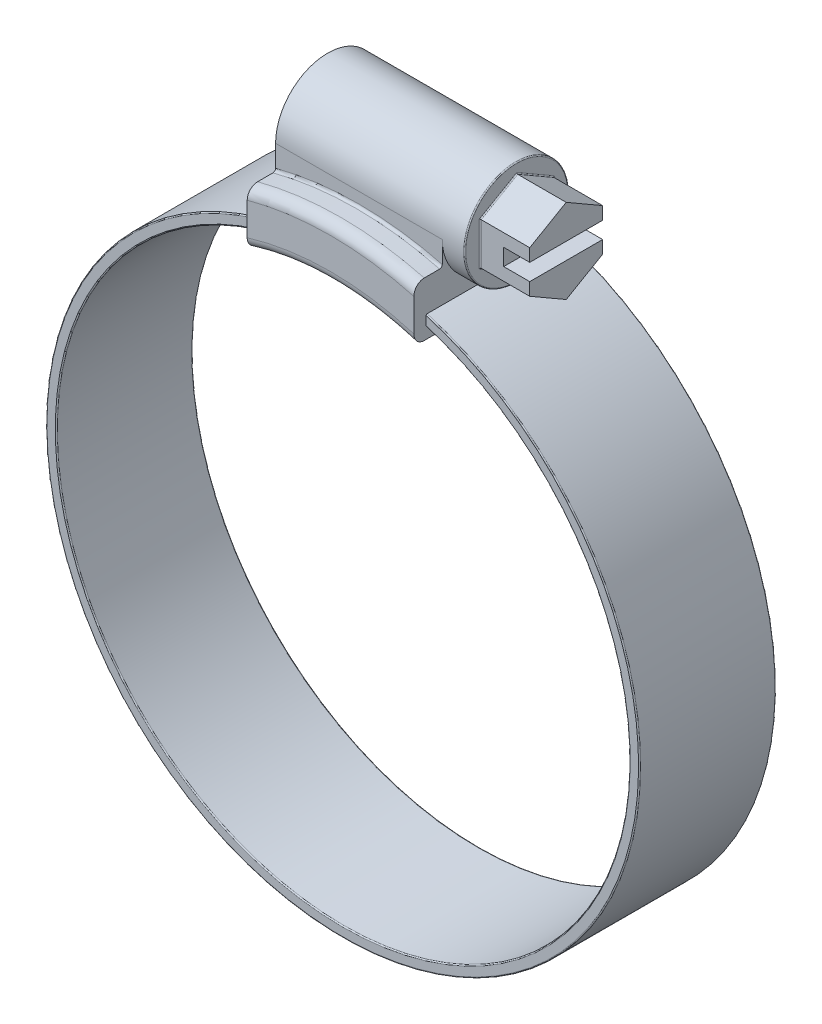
from build123d import *

# Parameters (mm, degrees)
SKETCH1_R                       = 28.5
SKETCH1_R_2                     = 27.5
EXTRUDE_THIN1_DEPTH             = 6.55
BOSS_EXTRUDE1_DEPTH             = 7.725
BOSS_EXTRUDE2_REACH             = 45.176
BOSS_EXTRUDE2_DIRECTION_2_REACH = 45.176
SKETCH7_R                       = 5
BOSS_EXTRUDE4_DEPTH             = 2.15
BOSS_EXTRUDE5_DEPTH             = 4.75
CUT_EXTRUDE1_DEPTH              = 2.5
FILLET1_R                       = 0.1
FILLET2_R                       = 1
FILLET3_R                       = 0.25


with BuildPart() as part:
    # Sketch1 → Extrude-Thin1 (new, symmetric)
    with BuildSketch(Plane.XY):
        Circle(SKETCH1_R)
        Circle(SKETCH1_R_2, mode=Mode.SUBTRACT)
    extrude(amount=EXTRUDE_THIN1_DEPTH, both=True)

    # Sketch2 → Boss-Extrude1 (add, symmetric)
    with BuildSketch(Plane.XY):
        with BuildLine():
            Line((-8, 30.467195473), (-8, 25.263610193))
            ThreePointArc((-8, 25.263610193), (0, 26.5), (8, 25.263610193))
            Line((8, 25.263610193), (8, 30.467195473))
            ThreePointArc((8, 30.467195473), (0, 31.5), (-8, 30.467195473))
        make_face()
    extrude(amount=BOSS_EXTRUDE1_DEPTH, both=True)

    # Boss-Extrude2: up to this face of the body (flat: up to its plane)
    boss_extrude2_end = Plane(part.part.faces().sort_by_distance((8, 28.077034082, 0))[0])
    # Sketch4 → Boss-Extrude2 (add, up to the picked face)
    with BuildSketch(Plane(origin=(0, 0, 0), x_dir=(0, 0, -1), z_dir=(1, 0, 0)), mode=Mode.PRIVATE) as boss_extrude2_sk1:
        with BuildLine():
            Line((-5, 32.8), (-5, 30.467195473))
            Line((-5, 30.467195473), (5, 30.467195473))
            Line((5, 30.467195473), (5, 32.8))
            ThreePointArc((5, 32.8), (0, 37.8), (-5, 32.8))
        make_face()
    boss_extrude2_tool1 = split(extrude(boss_extrude2_sk1.sketch, amount=BOSS_EXTRUDE2_REACH, mode=Mode.PRIVATE), bisect_by=boss_extrude2_end, keep=Keep.BOTH, mode=Mode.PRIVATE)
    add(boss_extrude2_tool1.solids().sort_by(Axis((0, 33.69657, 0), (1, 0, 0)))[0])

    # Boss-Extrude2 direction 2: up to this face of the body (flat: up to its plane)
    boss_extrude2_direction_2_end = Plane(part.part.faces().sort_by_distance((-8, 28.077034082, 0))[0])
    # Sketch4 → Boss-Extrude2 direction 2 (add, up to the picked face)
    with BuildSketch(Plane(origin=(0, 0, 0), x_dir=(0, 0, -1), z_dir=(1, 0, 0)), mode=Mode.PRIVATE) as boss_extrude2_direction_2_sk1:
        with BuildLine():
            Line((-5, 32.8), (-5, 30.467195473))
            Line((-5, 30.467195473), (5, 30.467195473))
            Line((5, 30.467195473), (5, 32.8))
            ThreePointArc((5, 32.8), (0, 37.8), (-5, 32.8))
        make_face()
    boss_extrude2_direction_2_tool1 = split(extrude(boss_extrude2_direction_2_sk1.sketch, amount=-BOSS_EXTRUDE2_DIRECTION_2_REACH, mode=Mode.PRIVATE), bisect_by=boss_extrude2_direction_2_end, keep=Keep.BOTH, mode=Mode.PRIVATE)
    add(boss_extrude2_direction_2_tool1.solids().sort_by(Axis((0, 33.69657, 0), (-1, 0, 0)))[0])

    # Sketch7 → Boss-Extrude4 (add)
    with BuildSketch(Plane(origin=(8, 0, 0), x_dir=(0, 0, -1), z_dir=(1, 0, 0))):
        with Locations((0, 32.8)):
            Circle(SKETCH7_R)
    extrude(amount=BOSS_EXTRUDE4_DEPTH)

    # Sketch8 → Boss-Extrude5 (add)
    with BuildSketch(Plane(origin=(10.15, 0, 0), x_dir=(0, 0, -1), z_dir=(1, 0, 0))):
        Polygon((0.000452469, 28.758548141), (3.500226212, 30.77966592), (3.499773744, 34.821117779), (-0.000452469, 36.841451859), (-3.500226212, 34.82033408), (-3.499773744, 30.778882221), align=None)
    extrude(amount=BOSS_EXTRUDE5_DEPTH)

    # Sketch9 → Cut-Extrude1 (cut)
    with BuildSketch(Plane(origin=(14.9, 0, 0), x_dir=(0, 0, -1), z_dir=(1, 0, 0))):
        Polygon((-3.95886158, 31.999556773), (3.959040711, 32.000443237), (3.95886158, 33.600443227), (-3.959040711, 33.599556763), align=None)
    extrude(amount=-CUT_EXTRUDE1_DEPTH, mode=Mode.SUBTRACT)

    # Fillet1
    fillet1_edges = [part.edges().sort_by_distance(p)[0] for p in [
        (0, -28.5, 6.55),
        (0, -28.5, -6.55),
        (10.15, 32.8, 5),
        (10.15, 29.768715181, 1.749660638),
        (10.15, 29.76910703, -1.75033934),
        (10.15, 32.800391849, -3.499999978),
        (10.15, 35.831284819, -1.749660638),
        (10.15, 35.83089297, 1.75033934),
        (10.15, 32.799608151, 3.499999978),
        (0, -27.5, 6.55),
        (0, -27.5, -6.55),
    ]]
    fillet(fillet1_edges, radius=FILLET1_R)

    # Fillet2
    fillet2_edges = [part.edges().sort_by_distance(p)[0] for p in [
        (0, 31.5, -7.725),
        (0, 26.5, -7.725),
        (0, 31.5, 7.725),
        (0, 26.5, 7.725),
    ]]
    fillet(fillet2_edges, radius=FILLET2_R)

    # Fillet3
    fillet3_edges = [part.edges().sort_by_distance(p)[0] for p in [
        (0, 31.5, -5),
        (0, 31.5, 5),
    ]]
    fillet(fillet3_edges, radius=FILLET3_R)


solid = part.part
